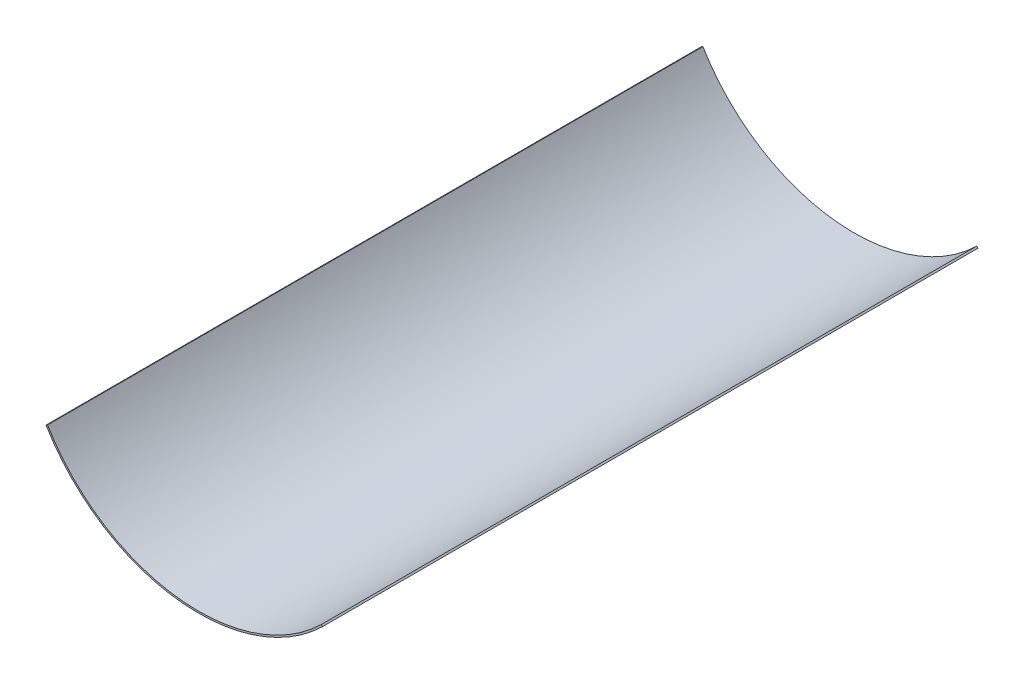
ISO-10303-21;
HEADER;
FILE_DESCRIPTION(('STEP AP214'),'2;1');
FILE_NAME('part.step','',(''),(''),'','','');
FILE_SCHEMA(('AUTOMOTIVE_DESIGN { 1 0 10303 214 1 1 1 1 }'));
ENDSEC;
DATA;
#1=APPLICATION_CONTEXT('core data for automotive mechanical design processes');
#2=APPLICATION_PROTOCOL_DEFINITION('international standard','automotive_design',2000,#1);
#3=PRODUCT_CONTEXT('',#1,'mechanical');
#4=PRODUCT('Part','Part','',(#3));
#5=PRODUCT_RELATED_PRODUCT_CATEGORY('part','',(#4));
#6=PRODUCT_DEFINITION_FORMATION('','',#4);
#7=PRODUCT_DEFINITION_CONTEXT('part definition',#1,'design');
#8=PRODUCT_DEFINITION('design','',#6,#7);
#9=PRODUCT_DEFINITION_SHAPE('','',#8);
#10=(LENGTH_UNIT() NAMED_UNIT(*) SI_UNIT(.MILLI.,.METRE.));
#11=(NAMED_UNIT(*) PLANE_ANGLE_UNIT() SI_UNIT($,.RADIAN.));
#12=(NAMED_UNIT(*) SI_UNIT($,.STERADIAN.) SOLID_ANGLE_UNIT());
#13=UNCERTAINTY_MEASURE_WITH_UNIT(LENGTH_MEASURE(1.E-05),#10,'distance_accuracy_value','');
#14=(GEOMETRIC_REPRESENTATION_CONTEXT(3) GLOBAL_UNCERTAINTY_ASSIGNED_CONTEXT((#13)) GLOBAL_UNIT_ASSIGNED_CONTEXT((#10,
#11,#12)) REPRESENTATION_CONTEXT('',''));
#15=CARTESIAN_POINT('',(0.,0.,0.));
#16=DIRECTION('',(0.,0.,1.));
#17=DIRECTION('',(1.,0.,0.));
#18=AXIS2_PLACEMENT_3D('',#15,#16,#17);
#19=CARTESIAN_POINT('',(0.,0.,745.));
#20=DIRECTION('',(0.,0.,-1.));
#21=DIRECTION('',(-1.,0.,0.));
#22=AXIS2_PLACEMENT_3D('',#19,#20,#21);
#23=CYLINDRICAL_SURFACE('',#22,202.);
#24=CARTESIAN_POINT('',(0.,0.,0.));
#25=DIRECTION('',(0.,0.,1.));
#26=DIRECTION('',(1.,0.,0.));
#27=AXIS2_PLACEMENT_3D('',#24,#25,#26);
#28=CIRCLE('',#27,202.);
#29=CARTESIAN_POINT('',(-173.474244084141,-103.492447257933,0.));
#30=VERTEX_POINT('',#29);
#31=CARTESIAN_POINT('',(140.973235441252,-144.673932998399,0.));
#32=VERTEX_POINT('',#31);
#33=EDGE_CURVE('E97',#30,#32,#28,.T.);
#34=ORIENTED_EDGE('',*,*,#33,.T.);
#35=DIRECTION('',(0.,0.,-1.));
#36=VECTOR('',#35,1.);
#37=CARTESIAN_POINT('',(140.973235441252,-144.673932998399,745.));
#38=LINE('',#37,#36);
#39=CARTESIAN_POINT('',(140.973235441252,-144.673932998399,745.));
#40=VERTEX_POINT('',#39);
#41=EDGE_CURVE('E11',#40,#32,#38,.T.);
#42=ORIENTED_EDGE('',*,*,#41,.F.);
#43=CARTESIAN_POINT('',(0.,0.,745.));
#44=DIRECTION('',(0.,0.,1.));
#45=DIRECTION('',(1.,0.,0.));
#46=AXIS2_PLACEMENT_3D('',#43,#44,#45);
#47=CIRCLE('',#46,202.);
#48=CARTESIAN_POINT('',(-173.474244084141,-103.492447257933,745.));
#49=VERTEX_POINT('',#48);
#50=EDGE_CURVE('E85',#49,#40,#47,.T.);
#51=ORIENTED_EDGE('',*,*,#50,.F.);
#52=DIRECTION('',(0.,0.,-1.));
#53=VECTOR('',#52,1.);
#54=CARTESIAN_POINT('',(-173.474244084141,-103.492447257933,745.));
#55=LINE('',#54,#53);
#56=EDGE_CURVE('E93',#49,#30,#55,.T.);
#57=ORIENTED_EDGE('',*,*,#56,.T.);
#58=EDGE_LOOP('',(#34,#42,#51,#57));
#59=FACE_BOUND('',#58,.T.);
#60=ADVANCED_FACE('F34',(#59),#23,.T.);
#61=CARTESIAN_POINT('',(140.973235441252,-144.673932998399,745.));
#62=DIRECTION('',(-0.716207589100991,-0.697887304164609,0.));
#63=DIRECTION('',(0.697887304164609,-0.716207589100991,0.));
#64=AXIS2_PLACEMENT_3D('',#61,#62,#63);
#65=PLANE('',#64);
#66=DIRECTION('',(-0.697887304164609,0.716207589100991,0.));
#67=VECTOR('',#66,1.);
#68=CARTESIAN_POINT('',(140.973235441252,-144.673932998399,0.));
#69=LINE('',#68,#67);
#70=CARTESIAN_POINT('',(139.577460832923,-143.241517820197,0.));
#71=VERTEX_POINT('',#70);
#72=EDGE_CURVE('E89',#32,#71,#69,.T.);
#73=ORIENTED_EDGE('',*,*,#72,.T.);
#74=DIRECTION('',(0.,0.,-1.));
#75=VECTOR('',#74,1.);
#76=CARTESIAN_POINT('',(139.577460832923,-143.241517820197,745.));
#77=LINE('',#76,#75);
#78=CARTESIAN_POINT('',(139.577460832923,-143.241517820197,745.));
#79=VERTEX_POINT('',#78);
#80=EDGE_CURVE('E42',#79,#71,#77,.T.);
#81=ORIENTED_EDGE('',*,*,#80,.F.);
#82=DIRECTION('',(-0.697887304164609,0.716207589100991,0.));
#83=VECTOR('',#82,1.);
#84=CARTESIAN_POINT('',(140.973235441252,-144.673932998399,745.));
#85=LINE('',#84,#83);
#86=EDGE_CURVE('E80',#40,#79,#85,.T.);
#87=ORIENTED_EDGE('',*,*,#86,.F.);
#88=ORIENTED_EDGE('',*,*,#41,.T.);
#89=EDGE_LOOP('',(#73,#81,#87,#88));
#90=FACE_BOUND('',#89,.T.);
#91=ADVANCED_FACE('F88',(#90),#65,.F.);
#92=CARTESIAN_POINT('',(0.,0.,745.));
#93=DIRECTION('',(0.,0.,-1.));
#94=DIRECTION('',(-1.,0.,0.));
#95=AXIS2_PLACEMENT_3D('',#92,#93,#94);
#96=CYLINDRICAL_SURFACE('',#95,200.);
#97=CARTESIAN_POINT('',(0.,0.,0.));
#98=DIRECTION('',(0.,0.,-1.));
#99=DIRECTION('',(1.,0.,0.));
#100=AXIS2_PLACEMENT_3D('',#97,#98,#99);
#101=CIRCLE('',#100,200.);
#102=CARTESIAN_POINT('',(-171.75667731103,-102.46776956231,0.));
#103=VERTEX_POINT('',#102);
#104=EDGE_CURVE('E67',#71,#103,#101,.T.);
#105=ORIENTED_EDGE('',*,*,#104,.T.);
#106=DIRECTION('',(0.,0.,-1.));
#107=VECTOR('',#106,1.);
#108=CARTESIAN_POINT('',(-171.75667731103,-102.46776956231,745.));
#109=LINE('',#108,#107);
#110=CARTESIAN_POINT('',(-171.75667731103,-102.46776956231,745.));
#111=VERTEX_POINT('',#110);
#112=EDGE_CURVE('E90',#111,#103,#109,.T.);
#113=ORIENTED_EDGE('',*,*,#112,.F.);
#114=CARTESIAN_POINT('',(0.,0.,745.));
#115=DIRECTION('',(0.,0.,-1.));
#116=DIRECTION('',(1.,0.,0.));
#117=AXIS2_PLACEMENT_3D('',#114,#115,#116);
#118=CIRCLE('',#117,200.);
#119=EDGE_CURVE('E83',#79,#111,#118,.T.);
#120=ORIENTED_EDGE('',*,*,#119,.F.);
#121=ORIENTED_EDGE('',*,*,#80,.T.);
#122=EDGE_LOOP('',(#105,#113,#120,#121));
#123=FACE_BOUND('',#122,.T.);
#124=ADVANCED_FACE('F91',(#123),#96,.F.);
#125=CARTESIAN_POINT('',(-171.75667731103,-102.46776956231,745.));
#126=DIRECTION('',(0.512338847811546,-0.858783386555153,0.));
#127=DIRECTION('',(0.858783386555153,0.512338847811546,0.));
#128=AXIS2_PLACEMENT_3D('',#125,#126,#127);
#129=PLANE('',#128);
#130=DIRECTION('',(-0.858783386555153,-0.512338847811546,0.));
#131=VECTOR('',#130,1.);
#132=CARTESIAN_POINT('',(-171.75667731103,-102.46776956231,0.));
#133=LINE('',#132,#131);
#134=EDGE_CURVE('E73',#103,#30,#133,.T.);
#135=ORIENTED_EDGE('',*,*,#134,.T.);
#136=ORIENTED_EDGE('',*,*,#56,.F.);
#137=DIRECTION('',(-0.858783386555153,-0.512338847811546,0.));
#138=VECTOR('',#137,1.);
#139=CARTESIAN_POINT('',(-171.75667731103,-102.46776956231,745.));
#140=LINE('',#139,#138);
#141=EDGE_CURVE('E50',#111,#49,#140,.T.);
#142=ORIENTED_EDGE('',*,*,#141,.F.);
#143=ORIENTED_EDGE('',*,*,#112,.T.);
#144=EDGE_LOOP('',(#135,#136,#142,#143));
#145=FACE_BOUND('',#144,.T.);
#146=ADVANCED_FACE('F104',(#145),#129,.F.);
#147=CARTESIAN_POINT('',(0.,0.,745.));
#148=DIRECTION('',(0.,0.,1.));
#149=DIRECTION('',(1.,0.,0.));
#150=AXIS2_PLACEMENT_3D('',#147,#148,#149);
#151=PLANE('',#150);
#152=ORIENTED_EDGE('',*,*,#50,.T.);
#153=ORIENTED_EDGE('',*,*,#86,.T.);
#154=ORIENTED_EDGE('',*,*,#119,.T.);
#155=ORIENTED_EDGE('',*,*,#141,.T.);
#156=EDGE_LOOP('',(#152,#153,#154,#155));
#157=FACE_BOUND('',#156,.T.);
#158=ADVANCED_FACE('F81',(#157),#151,.T.);
#159=CARTESIAN_POINT('',(0.,0.,0.));
#160=DIRECTION('',(0.,0.,1.));
#161=DIRECTION('',(1.,0.,0.));
#162=AXIS2_PLACEMENT_3D('',#159,#160,#161);
#163=PLANE('',#162);
#164=ORIENTED_EDGE('',*,*,#33,.F.);
#165=ORIENTED_EDGE('',*,*,#134,.F.);
#166=ORIENTED_EDGE('',*,*,#104,.F.);
#167=ORIENTED_EDGE('',*,*,#72,.F.);
#168=EDGE_LOOP('',(#164,#165,#166,#167));
#169=FACE_BOUND('',#168,.T.);
#170=ADVANCED_FACE('F107',(#169),#163,.F.);
#171=CLOSED_SHELL('',(#60,#91,#124,#146,#158,#170));
#172=MANIFOLD_SOLID_BREP('B2',#171);
#173=ADVANCED_BREP_SHAPE_REPRESENTATION('',(#18,#172),#14);
#174=SHAPE_DEFINITION_REPRESENTATION(#9,#173);
ENDSEC;
END-ISO-10303-21;
